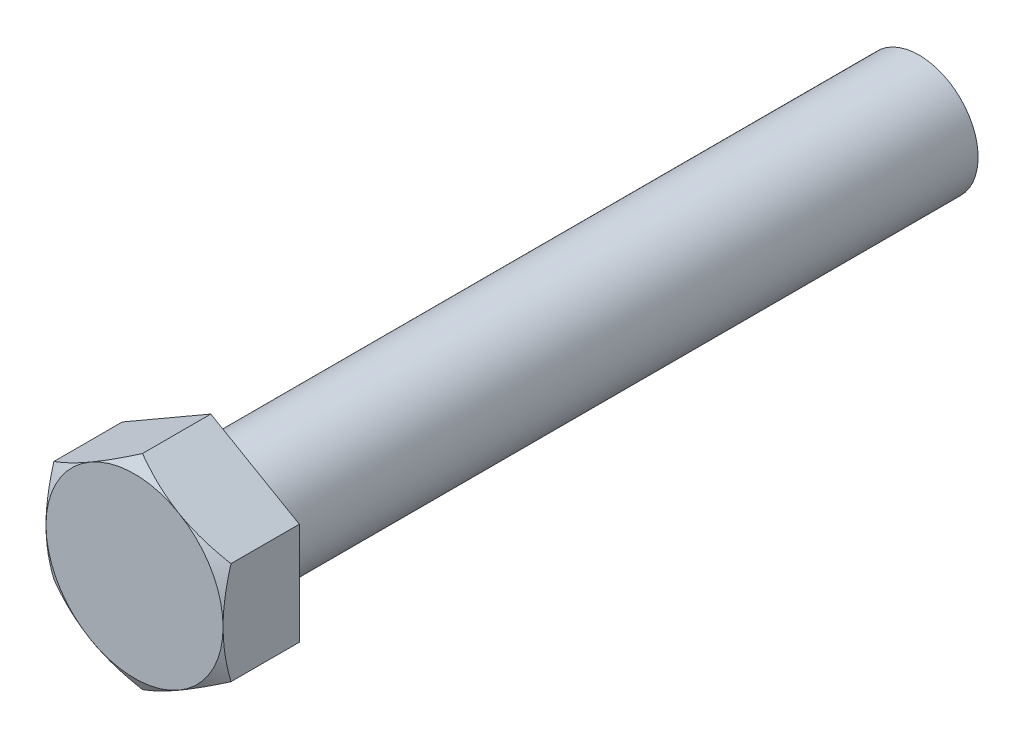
ISO-10303-21;
HEADER;
FILE_DESCRIPTION(('STEP AP214'),'2;1');
FILE_NAME('part.step','',(''),(''),'','','');
FILE_SCHEMA(('AUTOMOTIVE_DESIGN { 1 0 10303 214 1 1 1 1 }'));
ENDSEC;
DATA;
#1=APPLICATION_CONTEXT('core data for automotive mechanical design processes');
#2=APPLICATION_PROTOCOL_DEFINITION('international standard','automotive_design',2000,#1);
#3=PRODUCT_CONTEXT('',#1,'mechanical');
#4=PRODUCT('Part','Part','',(#3));
#5=PRODUCT_RELATED_PRODUCT_CATEGORY('part','',(#4));
#6=PRODUCT_DEFINITION_FORMATION('','',#4);
#7=PRODUCT_DEFINITION_CONTEXT('part definition',#1,'design');
#8=PRODUCT_DEFINITION('design','',#6,#7);
#9=PRODUCT_DEFINITION_SHAPE('','',#8);
#10=(LENGTH_UNIT() NAMED_UNIT(*) SI_UNIT(.MILLI.,.METRE.));
#11=(NAMED_UNIT(*) PLANE_ANGLE_UNIT() SI_UNIT($,.RADIAN.));
#12=(NAMED_UNIT(*) SI_UNIT($,.STERADIAN.) SOLID_ANGLE_UNIT());
#13=UNCERTAINTY_MEASURE_WITH_UNIT(LENGTH_MEASURE(1.E-05),#10,'distance_accuracy_value','');
#14=(GEOMETRIC_REPRESENTATION_CONTEXT(3) GLOBAL_UNCERTAINTY_ASSIGNED_CONTEXT((#13)) GLOBAL_UNIT_ASSIGNED_CONTEXT((#10,
#11,#12)) REPRESENTATION_CONTEXT('',''));
#15=CARTESIAN_POINT('',(0.,0.,0.));
#16=DIRECTION('',(0.,0.,1.));
#17=DIRECTION('',(1.,0.,0.));
#18=AXIS2_PLACEMENT_3D('',#15,#16,#17);
#19=CARTESIAN_POINT('',(0.,0.,76.2));
#20=DIRECTION('',(0.,0.,-1.));
#21=DIRECTION('',(-1.,0.,0.));
#22=AXIS2_PLACEMENT_3D('',#19,#20,#21);
#23=CYLINDRICAL_SURFACE('',#22,6.35);
#24=CARTESIAN_POINT('',(0.,0.,76.2));
#25=DIRECTION('',(0.,0.,1.));
#26=DIRECTION('',(1.,0.,0.));
#27=AXIS2_PLACEMENT_3D('',#24,#25,#26);
#28=CIRCLE('',#27,6.35);
#29=CARTESIAN_POINT('',(-6.35,0.,76.2));
#30=VERTEX_POINT('',#29);
#31=EDGE_CURVE('E199',#30,#30,#28,.T.);
#32=CARTESIAN_POINT('',(0.,0.,0.));
#33=DIRECTION('',(0.,0.,1.));
#34=DIRECTION('',(1.,0.,0.));
#35=AXIS2_PLACEMENT_3D('',#32,#33,#34);
#36=CIRCLE('',#35,6.35);
#37=CARTESIAN_POINT('',(-6.35,0.,0.));
#38=VERTEX_POINT('',#37);
#39=EDGE_CURVE('E197',#38,#38,#36,.T.);
#40=CARTESIAN_POINT('',(-6.35,0.,76.2));
#41=CARTESIAN_POINT('',(-6.35,0.,75.40625));
#42=CARTESIAN_POINT('',(-6.35,0.,74.6125));
#43=CARTESIAN_POINT('',(-6.35,0.,73.025));
#44=CARTESIAN_POINT('',(-6.35,0.,72.23125));
#45=CARTESIAN_POINT('',(-6.35,0.,70.64375));
#46=CARTESIAN_POINT('',(-6.35,0.,69.85));
#47=CARTESIAN_POINT('',(-6.35,0.,68.2625));
#48=CARTESIAN_POINT('',(-6.35,0.,67.46875));
#49=CARTESIAN_POINT('',(-6.35,0.,65.88125));
#50=CARTESIAN_POINT('',(-6.35,0.,65.0875));
#51=CARTESIAN_POINT('',(-6.35,0.,63.5));
#52=CARTESIAN_POINT('',(-6.35,0.,62.70625));
#53=CARTESIAN_POINT('',(-6.35,0.,61.11875));
#54=CARTESIAN_POINT('',(-6.35,0.,60.325));
#55=CARTESIAN_POINT('',(-6.35,0.,58.7375));
#56=CARTESIAN_POINT('',(-6.35,0.,57.94375));
#57=CARTESIAN_POINT('',(-6.35,0.,56.35625));
#58=CARTESIAN_POINT('',(-6.35,0.,55.5625));
#59=CARTESIAN_POINT('',(-6.35,0.,53.975));
#60=CARTESIAN_POINT('',(-6.35,0.,53.18125));
#61=CARTESIAN_POINT('',(-6.35,0.,51.59375));
#62=CARTESIAN_POINT('',(-6.35,0.,50.8));
#63=CARTESIAN_POINT('',(-6.35,0.,49.2125));
#64=CARTESIAN_POINT('',(-6.35,0.,48.41875));
#65=CARTESIAN_POINT('',(-6.35,0.,46.83125));
#66=CARTESIAN_POINT('',(-6.35,0.,46.0375));
#67=CARTESIAN_POINT('',(-6.35,0.,44.45));
#68=CARTESIAN_POINT('',(-6.35,0.,43.65625));
#69=CARTESIAN_POINT('',(-6.35,0.,42.06875));
#70=CARTESIAN_POINT('',(-6.35,0.,41.275));
#71=CARTESIAN_POINT('',(-6.35,0.,39.6875));
#72=CARTESIAN_POINT('',(-6.35,0.,38.89375));
#73=CARTESIAN_POINT('',(-6.35,0.,37.30625));
#74=CARTESIAN_POINT('',(-6.35,0.,36.5125));
#75=CARTESIAN_POINT('',(-6.35,0.,34.925));
#76=CARTESIAN_POINT('',(-6.35,0.,34.13125));
#77=CARTESIAN_POINT('',(-6.35,0.,32.54375));
#78=CARTESIAN_POINT('',(-6.35,0.,31.75));
#79=CARTESIAN_POINT('',(-6.35,0.,30.1625));
#80=CARTESIAN_POINT('',(-6.35,0.,29.36875));
#81=CARTESIAN_POINT('',(-6.35,0.,27.78125));
#82=CARTESIAN_POINT('',(-6.35,0.,26.9875));
#83=CARTESIAN_POINT('',(-6.35,0.,25.4));
#84=CARTESIAN_POINT('',(-6.35,0.,24.60625));
#85=CARTESIAN_POINT('',(-6.35,0.,23.01875));
#86=CARTESIAN_POINT('',(-6.35,0.,22.225));
#87=CARTESIAN_POINT('',(-6.35,0.,20.6375));
#88=CARTESIAN_POINT('',(-6.35,0.,19.84375));
#89=CARTESIAN_POINT('',(-6.35,0.,18.25625));
#90=CARTESIAN_POINT('',(-6.35,0.,17.4625));
#91=CARTESIAN_POINT('',(-6.35,0.,15.875));
#92=CARTESIAN_POINT('',(-6.35,0.,15.08125));
#93=CARTESIAN_POINT('',(-6.35,0.,13.49375));
#94=CARTESIAN_POINT('',(-6.35,0.,12.7));
#95=CARTESIAN_POINT('',(-6.35,0.,11.1125));
#96=CARTESIAN_POINT('',(-6.35,0.,10.31875));
#97=CARTESIAN_POINT('',(-6.35,0.,8.73125));
#98=CARTESIAN_POINT('',(-6.35,0.,7.93750000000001));
#99=CARTESIAN_POINT('',(-6.35,0.,6.35));
#100=CARTESIAN_POINT('',(-6.35,0.,5.55625));
#101=CARTESIAN_POINT('',(-6.35,0.,3.96875));
#102=CARTESIAN_POINT('',(-6.35,0.,3.175));
#103=CARTESIAN_POINT('',(-6.35,0.,1.5875));
#104=CARTESIAN_POINT('',(-6.35,0.,0.793750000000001));
#105=CARTESIAN_POINT('',(-6.35,0.,0.));
#106=B_SPLINE_CURVE_WITH_KNOTS('',3,(#40,#41,#42,#43,#44,#45,#46,#47,#48,#49,#50,#51,#52,#53,
#54,#55,#56,#57,#58,#59,#60,#61,#62,#63,#64,#65,#66,#67,#68,#69,#70,#71,#72,#73,#74,#75,#76,#77,
#78,#79,#80,#81,#82,#83,#84,#85,#86,#87,#88,#89,#90,#91,#92,#93,#94,#95,#96,#97,#98,#99,#100,
#101,#102,#103,#104,#105),.UNSPECIFIED.,.F.,.F.,(4,2,2,2,2,2,2,2,2,2,2,2,2,2,2,2,2,2,2,2,2,2,2,
2,2,2,2,2,2,2,2,2,4),(0.,2.38124999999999,4.76249999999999,7.14374999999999,9.52499999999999,
11.90625,14.2875,16.66875,19.05,21.43125,23.8125,26.19375,28.575,30.95625,33.3375,35.71875,38.1,
40.48125,42.8625,45.24375,47.625,50.00625,52.3875,54.76875,57.15,59.53125,61.9125,64.29375,
66.675,69.05625,71.4375,73.81875,76.2),.UNSPECIFIED.);
#107=EDGE_CURVE('BSEAM30',#30,#38,#106,.T.);
#108=ORIENTED_EDGE('',*,*,#31,.F.);
#109=ORIENTED_EDGE('',*,*,#39,.T.);
#110=ORIENTED_EDGE('',*,*,#107,.T.);
#111=ORIENTED_EDGE('',*,*,#107,.F.);
#112=EDGE_LOOP('',(#108,#110,#109,#111));
#113=FACE_BOUND('',#112,.T.);
#114=ADVANCED_FACE('F30',(#113),#23,.T.);
#115=CARTESIAN_POINT('',(0.,0.,0.));
#116=DIRECTION('',(0.,0.,1.));
#117=DIRECTION('',(1.,0.,0.));
#118=AXIS2_PLACEMENT_3D('',#115,#116,#117);
#119=PLANE('',#118);
#120=ORIENTED_EDGE('',*,*,#39,.F.);
#121=EDGE_LOOP('',(#120));
#122=FACE_BOUND('',#121,.T.);
#123=ADVANCED_FACE('F186',(#122),#119,.F.);
#124=CARTESIAN_POINT('',(-9.525,5.49926131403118,76.2));
#125=DIRECTION('',(0.,0.,1.));
#126=DIRECTION('',(1.,0.,0.));
#127=AXIS2_PLACEMENT_3D('',#124,#125,#126);
#128=PLANE('',#127);
#129=DIRECTION('',(-0.866025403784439,-0.5,0.));
#130=VECTOR('',#129,1.);
#131=CARTESIAN_POINT('',(0.,10.9985226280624,76.2));
#132=LINE('',#131,#130);
#133=CARTESIAN_POINT('',(0.,10.9985226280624,76.2));
#134=VERTEX_POINT('',#133);
#135=CARTESIAN_POINT('',(-9.525,5.49926131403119,76.2));
#136=VERTEX_POINT('',#135);
#137=EDGE_CURVE('E228',#134,#136,#132,.T.);
#138=ORIENTED_EDGE('',*,*,#137,.F.);
#139=DIRECTION('',(0.866025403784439,-0.5,0.));
#140=VECTOR('',#139,1.);
#141=CARTESIAN_POINT('',(0.,10.9985226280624,76.2));
#142=LINE('',#141,#140);
#143=CARTESIAN_POINT('',(9.525,5.49926131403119,76.2));
#144=VERTEX_POINT('',#143);
#145=EDGE_CURVE('E214',#134,#144,#142,.T.);
#146=ORIENTED_EDGE('',*,*,#145,.T.);
#147=DIRECTION('',(0.,-1.,0.));
#148=VECTOR('',#147,1.);
#149=CARTESIAN_POINT('',(9.525,5.49926131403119,76.2));
#150=LINE('',#149,#148);
#151=CARTESIAN_POINT('',(9.525,-5.49926131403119,76.2));
#152=VERTEX_POINT('',#151);
#153=EDGE_CURVE('E217',#144,#152,#150,.T.);
#154=ORIENTED_EDGE('',*,*,#153,.T.);
#155=DIRECTION('',(-0.866025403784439,-0.5,0.));
#156=VECTOR('',#155,1.);
#157=CARTESIAN_POINT('',(9.525,-5.49926131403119,76.2));
#158=LINE('',#157,#156);
#159=CARTESIAN_POINT('',(0.,-10.9985226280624,76.2));
#160=VERTEX_POINT('',#159);
#161=EDGE_CURVE('E220',#152,#160,#158,.T.);
#162=ORIENTED_EDGE('',*,*,#161,.T.);
#163=DIRECTION('',(0.866025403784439,-0.5,0.));
#164=VECTOR('',#163,1.);
#165=CARTESIAN_POINT('',(-9.525,-5.49926131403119,76.2));
#166=LINE('',#165,#164);
#167=CARTESIAN_POINT('',(-9.525,-5.49926131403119,76.2));
#168=VERTEX_POINT('',#167);
#169=EDGE_CURVE('E223',#168,#160,#166,.T.);
#170=ORIENTED_EDGE('',*,*,#169,.F.);
#171=DIRECTION('',(0.,-1.,0.));
#172=VECTOR('',#171,1.);
#173=CARTESIAN_POINT('',(-9.525,5.49926131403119,76.2));
#174=LINE('',#173,#172);
#175=EDGE_CURVE('E226',#136,#168,#174,.T.);
#176=ORIENTED_EDGE('',*,*,#175,.F.);
#177=EDGE_LOOP('',(#138,#146,#154,#162,#170,#176));
#178=FACE_BOUND('',#177,.T.);
#179=ORIENTED_EDGE('',*,*,#31,.T.);
#180=EDGE_LOOP('',(#179));
#181=FACE_BOUND('',#180,.T.);
#182=ADVANCED_FACE('F141',(#178,#181),#128,.F.);
#183=CARTESIAN_POINT('',(0.,10.9985226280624,84.4042));
#184=DIRECTION('',(0.5,-0.866025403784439,0.));
#185=DIRECTION('',(0.866025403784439,0.5,0.));
#186=AXIS2_PLACEMENT_3D('',#183,#184,#185);
#187=PLANE('',#186);
#188=CARTESIAN_POINT('',(0.000199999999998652,10.9986380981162,83.5533946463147));
#189=CARTESIAN_POINT('',(-0.209180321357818,10.8777523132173,83.6231767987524));
#190=CARTESIAN_POINT('',(-0.419341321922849,10.7564158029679,83.6897917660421));
#191=CARTESIAN_POINT('',(-0.841348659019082,10.5127697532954,83.81580853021));
#192=CARTESIAN_POINT('',(-1.05319552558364,10.3904599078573,83.8752079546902));
#193=CARTESIAN_POINT('',(-1.69214962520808,10.0215595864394,84.0414333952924));
#194=CARTESIAN_POINT('',(-2.12177921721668,9.77351282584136,84.1359816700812));
#195=CARTESIAN_POINT('',(-2.76470023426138,9.40232220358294,84.2468483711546));
#196=CARTESIAN_POINT('',(-2.97607088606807,9.28028730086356,84.278430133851));
#197=CARTESIAN_POINT('',(-3.39979082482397,9.03565248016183,84.3313907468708));
#198=CARTESIAN_POINT('',(-3.61214013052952,8.9130525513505,84.352769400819));
#199=CARTESIAN_POINT('',(-4.03719295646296,8.66764818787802,84.3847760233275));
#200=CARTESIAN_POINT('',(-4.24989575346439,8.54484417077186,84.3954167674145));
#201=CARTESIAN_POINT('',(-4.67549782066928,8.29912270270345,84.4057214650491));
#202=CARTESIAN_POINT('',(-4.88839708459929,8.17620525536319,84.4053857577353));
#203=CARTESIAN_POINT('',(-5.28641747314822,7.94640807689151,84.3945011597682));
#204=CARTESIAN_POINT('',(-5.4715666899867,7.83951212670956,84.3852800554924));
#205=CARTESIAN_POINT('',(-5.84143209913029,7.62597023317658,84.3587151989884));
#206=CARTESIAN_POINT('',(-6.02614825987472,7.5193243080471,84.3413708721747));
#207=CARTESIAN_POINT('',(-6.57958100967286,7.19979976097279,84.2775631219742));
#208=CARTESIAN_POINT('',(-6.94731798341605,6.98748672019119,84.2193328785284));
#209=CARTESIAN_POINT('',(-7.68669273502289,6.56060850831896,84.0737567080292));
#210=CARTESIAN_POINT('',(-8.05823615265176,6.34609781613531,83.9857937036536));
#211=CARTESIAN_POINT('',(-8.79578238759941,5.92027529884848,83.786154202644));
#212=CARTESIAN_POINT('',(-9.16179464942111,5.70895802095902,83.6745245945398));
#213=CARTESIAN_POINT('',(-9.5252,5.49914584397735,83.5533946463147));
#214=B_SPLINE_CURVE_WITH_KNOTS('',3,(#188,#189,#190,#191,#192,#193,#194,#195,#196,#197,#198,
#199,#200,#201,#202,#203,#204,#205,#206,#207,#208,#209,#210,#211,#212,#213),.UNSPECIFIED.,.F.,
.F.,(4,2,2,2,2,2,2,2,2,2,2,2,4),(0.,0.754861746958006,1.50997101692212,3.02340406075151,
3.76154608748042,4.49970232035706,5.23697928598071,5.97423347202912,6.61604550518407,
7.25790294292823,8.54252993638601,9.85564695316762,11.1661863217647),.UNSPECIFIED.);
#215=CARTESIAN_POINT('',(0.,10.9985226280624,83.5534613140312));
#216=VERTEX_POINT('',#215);
#217=CARTESIAN_POINT('',(-4.7625,8.24889197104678,84.4042));
#218=VERTEX_POINT('',#217);
#219=EDGE_CURVE('E108',#216,#218,#214,.T.);
#220=ORIENTED_EDGE('',*,*,#219,.F.);
#221=DIRECTION('',(0.,0.,-1.));
#222=VECTOR('',#221,1.);
#223=CARTESIAN_POINT('',(0.,10.9985226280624,84.4042));
#224=LINE('',#223,#222);
#225=EDGE_CURVE('E121',#216,#134,#224,.T.);
#226=ORIENTED_EDGE('',*,*,#225,.T.);
#227=ORIENTED_EDGE('',*,*,#137,.T.);
#228=DIRECTION('',(0.,0.,-1.));
#229=VECTOR('',#228,1.);
#230=CARTESIAN_POINT('',(-9.525,5.49926131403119,84.4042));
#231=LINE('',#230,#229);
#232=CARTESIAN_POINT('',(-9.525,5.49926131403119,83.5534613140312));
#233=VERTEX_POINT('',#232);
#234=EDGE_CURVE('E200',#233,#136,#231,.T.);
#235=ORIENTED_EDGE('',*,*,#234,.F.);
#236=EDGE_CURVE('E255',#218,#233,#214,.T.);
#237=ORIENTED_EDGE('',*,*,#236,.F.);
#238=EDGE_LOOP('',(#220,#226,#227,#235,#237));
#239=FACE_BOUND('',#238,.T.);
#240=ADVANCED_FACE('F181',(#239),#187,.F.);
#241=CARTESIAN_POINT('',(-9.525,5.49926131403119,84.4042));
#242=DIRECTION('',(1.,0.,0.));
#243=DIRECTION('',(0.,1.,0.));
#244=AXIS2_PLACEMENT_3D('',#241,#242,#243);
#245=PLANE('',#244);
#246=CARTESIAN_POINT('',(-9.52499999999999,-15.0406624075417,79.624888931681));
#247=CARTESIAN_POINT('',(-9.52499999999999,-14.8314695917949,79.726924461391));
#248=CARTESIAN_POINT('',(-9.52499999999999,-14.6220384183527,79.8284710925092));
#249=CARTESIAN_POINT('',(-9.52499999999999,-14.2026497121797,80.0304763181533));
#250=CARTESIAN_POINT('',(-9.52499999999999,-13.9926921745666,80.1309349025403));
#251=CARTESIAN_POINT('',(-9.52499999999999,-13.36190316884,80.4305380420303));
#252=CARTESIAN_POINT('',(-9.52499999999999,-12.940213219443,80.6278816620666));
#253=CARTESIAN_POINT('',(-9.52499999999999,-12.0919310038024,81.0176281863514));
#254=CARTESIAN_POINT('',(-9.52499999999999,-11.6653246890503,81.210000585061));
#255=CARTESIAN_POINT('',(-9.52499999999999,-10.8088119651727,81.5872256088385));
#256=CARTESIAN_POINT('',(-9.52499999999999,-10.3789057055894,81.772078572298));
#257=CARTESIAN_POINT('',(-9.52499999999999,-9.50033997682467,82.1384419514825));
#258=CARTESIAN_POINT('',(-9.52499999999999,-9.0515419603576,82.3196218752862));
#259=CARTESIAN_POINT('',(-9.52499999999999,-8.14879690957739,82.6689095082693));
#260=CARTESIAN_POINT('',(-9.525,-7.6948493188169,82.8370157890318));
#261=CARTESIAN_POINT('',(-9.525,-6.78184303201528,83.1559390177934));
#262=CARTESIAN_POINT('',(-9.525,-6.32279590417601,83.3067887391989));
#263=CARTESIAN_POINT('',(-9.525,-5.3981384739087,83.5865389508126));
#264=CARTESIAN_POINT('',(-9.525,-4.93253020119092,83.7154460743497));
#265=CARTESIAN_POINT('',(-9.525,-3.9969954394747,83.9446125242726));
#266=CARTESIAN_POINT('',(-9.52499999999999,-3.52710966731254,84.0450336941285));
#267=CARTESIAN_POINT('',(-9.525,-2.81779554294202,84.1700845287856));
#268=CARTESIAN_POINT('',(-9.525,-2.58059477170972,84.2075062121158));
#269=CARTESIAN_POINT('',(-9.525,-2.10492505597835,84.2730960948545));
#270=CARTESIAN_POINT('',(-9.525,-1.86645623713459,84.301265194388));
#271=CARTESIAN_POINT('',(-9.525,-1.39180240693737,84.3474207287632));
#272=CARTESIAN_POINT('',(-9.525,-1.15563040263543,84.3655403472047));
#273=CARTESIAN_POINT('',(-9.525,-0.682730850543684,84.3917658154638));
#274=CARTESIAN_POINT('',(-9.525,-0.446003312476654,84.3998718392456));
#275=CARTESIAN_POINT('',(-9.525,0.0275845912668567,84.4058754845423));
#276=CARTESIAN_POINT('',(-9.525,0.264444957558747,84.4037730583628));
#277=CARTESIAN_POINT('',(-9.525,0.737860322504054,84.389413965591));
#278=CARTESIAN_POINT('',(-9.525,0.974415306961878,84.3771568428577));
#279=CARTESIAN_POINT('',(-9.525,1.53488964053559,84.3363512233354));
#280=CARTESIAN_POINT('',(-9.525,1.85849825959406,84.3034324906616));
#281=CARTESIAN_POINT('',(-9.525,2.50347270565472,84.2203273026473));
#282=CARTESIAN_POINT('',(-9.525,2.82483825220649,84.1701387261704));
#283=CARTESIAN_POINT('',(-9.525,3.78510442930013,83.9963166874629));
#284=CARTESIAN_POINT('',(-9.525,4.41986459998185,83.8494526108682));
#285=CARTESIAN_POINT('',(-9.525,5.36956818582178,83.5927029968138));
#286=CARTESIAN_POINT('',(-9.525,5.68937698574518,83.4997612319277));
#287=CARTESIAN_POINT('',(-9.525,6.32589361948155,83.3037102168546));
#288=CARTESIAN_POINT('',(-9.525,6.64260142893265,83.2006008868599));
#289=CARTESIAN_POINT('',(-9.525,7.27300970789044,82.9859114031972));
#290=CARTESIAN_POINT('',(-9.525,7.58671097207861,82.8743335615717));
#291=CARTESIAN_POINT('',(-9.525,8.21147690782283,82.6440710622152));
#292=CARTESIAN_POINT('',(-9.525,8.52254164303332,82.525386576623));
#293=CARTESIAN_POINT('',(-9.525,9.36987521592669,82.1927669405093));
#294=CARTESIAN_POINT('',(-9.525,9.90380457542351,81.972877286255));
#295=CARTESIAN_POINT('',(-9.525,10.9660580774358,81.5199035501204));
#296=CARTESIAN_POINT('',(-9.525,11.4943815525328,81.2868179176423));
#297=CARTESIAN_POINT('',(-9.525,12.5467322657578,80.8106189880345));
#298=CARTESIAN_POINT('',(-9.525,13.0707576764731,80.5675016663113));
#299=CARTESIAN_POINT('',(-9.525,14.1151779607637,80.0736737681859));
#300=CARTESIAN_POINT('',(-9.525,14.6355729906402,79.8229635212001));
#301=CARTESIAN_POINT('',(-9.525,15.6743306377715,79.3152004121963));
#302=CARTESIAN_POINT('',(-9.525,16.1926884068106,79.0581376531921));
#303=CARTESIAN_POINT('',(-9.525,17.2270504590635,78.5393166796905));
#304=CARTESIAN_POINT('',(-9.525,17.7430547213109,78.2775584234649));
#305=CARTESIAN_POINT('',(-9.525,18.7730147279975,77.7503410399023));
#306=CARTESIAN_POINT('',(-9.525,19.2869709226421,77.4848827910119));
#307=CARTESIAN_POINT('',(-9.525,20.3132919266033,76.9509058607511));
#308=CARTESIAN_POINT('',(-9.525,20.8256567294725,76.6823871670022));
#309=CARTESIAN_POINT('',(-9.525,22.2501429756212,75.9314003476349));
#310=CARTESIAN_POINT('',(-9.525,23.1608246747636,75.4462018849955));
#311=CARTESIAN_POINT('',(-9.525,24.9791566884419,74.4700292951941));
#312=CARTESIAN_POINT('',(-9.52500000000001,25.8868068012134,73.9790547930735));
#313=CARTESIAN_POINT('',(-9.52500000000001,27.69662744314,72.9945162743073));
#314=CARTESIAN_POINT('',(-9.52500000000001,28.598806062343,72.5009671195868));
#315=CARTESIAN_POINT('',(-9.52500000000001,29.9506881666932,71.7582112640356));
#316=CARTESIAN_POINT('',(-9.52500000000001,30.4010662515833,71.5102307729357));
#317=CARTESIAN_POINT('',(-9.52500000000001,31.301421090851,71.013543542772));
#318=CARTESIAN_POINT('',(-9.52500000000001,31.7513978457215,70.7648368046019));
#319=CARTESIAN_POINT('',(-9.52500000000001,32.2011986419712,70.5158121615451));
#320=B_SPLINE_CURVE_WITH_KNOTS('',3,(#246,#247,#248,#249,#250,#251,#252,#253,#254,#255,#256,
#257,#258,#259,#260,#261,#262,#263,#264,#265,#266,#267,#268,#269,#270,#271,#272,#273,#274,#275,
#276,#277,#278,#279,#280,#281,#282,#283,#284,#285,#286,#287,#288,#289,#290,#291,#292,#293,#294,
#295,#296,#297,#298,#299,#300,#301,#302,#303,#304,#305,#306,#307,#308,#309,#310,#311,#312,#313,
#314,#315,#316,#317,#318,#319),.UNSPECIFIED.,.F.,.F.,(4,2,2,2,2,2,2,2,2,2,2,2,2,2,2,2,2,2,2,2,2,
2,2,2,2,2,2,2,2,2,2,2,2,2,2,2,4),(0.,0.698250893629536,1.39650828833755,2.79321646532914,
4.19708297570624,5.60088623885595,7.05269653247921,8.50466522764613,9.95382890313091,
11.4025537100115,12.8428747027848,13.5631263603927,14.2833079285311,14.9937019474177,
15.7040836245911,16.414468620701,17.1248855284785,18.1001761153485,19.075586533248,
21.0273363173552,22.0263661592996,23.0254038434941,24.0241697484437,25.0229114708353,
26.7549509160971,28.4871943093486,30.2201395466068,31.953009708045,33.6887750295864,
35.4245557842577,37.1599312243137,38.895313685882,41.9908956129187,45.0866796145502,
48.1717395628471,49.7141439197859,51.2565463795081),.UNSPECIFIED.);
#321=CARTESIAN_POINT('',(-9.525,0.,84.4042));
#322=VERTEX_POINT('',#321);
#323=EDGE_CURVE('E230',#233,#322,#320,.F.);
#324=ORIENTED_EDGE('',*,*,#323,.F.);
#325=ORIENTED_EDGE('',*,*,#234,.T.);
#326=ORIENTED_EDGE('',*,*,#175,.T.);
#327=DIRECTION('',(0.,0.,-1.));
#328=VECTOR('',#327,1.);
#329=CARTESIAN_POINT('',(-9.525,-5.49926131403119,84.4042));
#330=LINE('',#329,#328);
#331=CARTESIAN_POINT('',(-9.525,-5.49926131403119,83.5534613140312));
#332=VERTEX_POINT('',#331);
#333=EDGE_CURVE('E203',#332,#168,#330,.T.);
#334=ORIENTED_EDGE('',*,*,#333,.F.);
#335=EDGE_CURVE('E166',#322,#332,#320,.F.);
#336=ORIENTED_EDGE('',*,*,#335,.F.);
#337=EDGE_LOOP('',(#324,#325,#326,#334,#336));
#338=FACE_BOUND('',#337,.T.);
#339=ADVANCED_FACE('F176',(#338),#245,.F.);
#340=CARTESIAN_POINT('',(-9.525,-5.49926131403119,84.4042));
#341=DIRECTION('',(0.5,0.866025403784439,0.));
#342=DIRECTION('',(-0.866025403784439,0.5,0.));
#343=AXIS2_PLACEMENT_3D('',#340,#341,#342);
#344=PLANE('',#343);
#345=CARTESIAN_POINT('',(-9.5252,-5.49914584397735,83.5533946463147));
#346=CARTESIAN_POINT('',(-9.31581967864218,-5.6200316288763,83.6231767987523));
#347=CARTESIAN_POINT('',(-9.10565867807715,-5.74136813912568,83.6897917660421));
#348=CARTESIAN_POINT('',(-8.68365134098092,-5.98501418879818,83.81580853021));
#349=CARTESIAN_POINT('',(-8.47180447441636,-6.10732403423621,83.8752079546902));
#350=CARTESIAN_POINT('',(-7.83285037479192,-6.4762243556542,84.0414333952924));
#351=CARTESIAN_POINT('',(-7.40322078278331,-6.72427111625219,84.1359816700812));
#352=CARTESIAN_POINT('',(-6.76029976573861,-7.09546173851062,84.2468483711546));
#353=CARTESIAN_POINT('',(-6.54892911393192,-7.21749664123,84.278430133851));
#354=CARTESIAN_POINT('',(-6.12520917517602,-7.46213146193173,84.3313907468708));
#355=CARTESIAN_POINT('',(-5.91285986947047,-7.58473139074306,84.352769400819));
#356=CARTESIAN_POINT('',(-5.48780704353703,-7.83013575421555,84.3847760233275));
#357=CARTESIAN_POINT('',(-5.2751042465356,-7.9529397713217,84.3954167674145));
#358=CARTESIAN_POINT('',(-4.84950217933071,-8.19866123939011,84.4057214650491));
#359=CARTESIAN_POINT('',(-4.6366029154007,-8.32157868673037,84.4053857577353));
#360=CARTESIAN_POINT('',(-4.23858252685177,-8.55137586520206,84.3945011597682));
#361=CARTESIAN_POINT('',(-4.05343331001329,-8.658271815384,84.3852800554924));
#362=CARTESIAN_POINT('',(-3.6835679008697,-8.87181370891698,84.3587151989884));
#363=CARTESIAN_POINT('',(-3.49885174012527,-8.97845963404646,84.3413708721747));
#364=CARTESIAN_POINT('',(-2.94541899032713,-9.29798418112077,84.2775631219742));
#365=CARTESIAN_POINT('',(-2.57768201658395,-9.51029722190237,84.2193328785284));
#366=CARTESIAN_POINT('',(-1.83830726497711,-9.93717543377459,84.0737567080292));
#367=CARTESIAN_POINT('',(-1.46676384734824,-10.1516861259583,83.9857937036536));
#368=CARTESIAN_POINT('',(-0.729217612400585,-10.5775086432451,83.786154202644));
#369=CARTESIAN_POINT('',(-0.363205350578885,-10.7888259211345,83.6745245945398));
#370=CARTESIAN_POINT('',(0.000199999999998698,-10.9986380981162,83.5533946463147));
#371=B_SPLINE_CURVE_WITH_KNOTS('',3,(#345,#346,#347,#348,#349,#350,#351,#352,#353,#354,#355,
#356,#357,#358,#359,#360,#361,#362,#363,#364,#365,#366,#367,#368,#369,#370),.UNSPECIFIED.,.F.,
.F.,(4,2,2,2,2,2,2,2,2,2,2,2,4),(0.,0.754861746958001,1.50997101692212,3.02340406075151,
3.76154608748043,4.49970232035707,5.23697928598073,5.97423347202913,6.61604550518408,
7.25790294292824,8.54252993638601,9.85564695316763,11.1661863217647),.UNSPECIFIED.);
#372=CARTESIAN_POINT('',(-4.7625,-8.24889197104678,84.4042));
#373=VERTEX_POINT('',#372);
#374=EDGE_CURVE('E164',#332,#373,#371,.T.);
#375=ORIENTED_EDGE('',*,*,#374,.F.);
#376=ORIENTED_EDGE('',*,*,#333,.T.);
#377=ORIENTED_EDGE('',*,*,#169,.T.);
#378=DIRECTION('',(0.,0.,-1.));
#379=VECTOR('',#378,1.);
#380=CARTESIAN_POINT('',(0.,-10.9985226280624,84.4042));
#381=LINE('',#380,#379);
#382=CARTESIAN_POINT('',(0.,-10.9985226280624,83.5534613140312));
#383=VERTEX_POINT('',#382);
#384=EDGE_CURVE('E207',#383,#160,#381,.T.);
#385=ORIENTED_EDGE('',*,*,#384,.F.);
#386=EDGE_CURVE('E159',#373,#383,#371,.T.);
#387=ORIENTED_EDGE('',*,*,#386,.F.);
#388=EDGE_LOOP('',(#375,#376,#377,#385,#387));
#389=FACE_BOUND('',#388,.T.);
#390=ADVANCED_FACE('F172',(#389),#344,.F.);
#391=CARTESIAN_POINT('',(9.525,-5.49926131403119,84.4042));
#392=DIRECTION('',(0.5,-0.866025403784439,0.));
#393=DIRECTION('',(0.866025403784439,0.5,0.));
#394=AXIS2_PLACEMENT_3D('',#391,#392,#393);
#395=PLANE('',#394);
#396=DIRECTION('',(0.,0.,-1.));
#397=VECTOR('',#396,1.);
#398=CARTESIAN_POINT('',(9.525,-5.49926131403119,84.4042));
#399=LINE('',#398,#397);
#400=CARTESIAN_POINT('',(9.525,-5.49926131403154,83.5534613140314));
#401=VERTEX_POINT('',#400);
#402=EDGE_CURVE('E209',#401,#152,#399,.T.);
#403=ORIENTED_EDGE('',*,*,#402,.F.);
#404=CARTESIAN_POINT('',(9.5252,-5.49914584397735,83.5533946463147));
#405=CARTESIAN_POINT('',(9.31581967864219,-5.62003162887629,83.6231767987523));
#406=CARTESIAN_POINT('',(9.10565867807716,-5.74136813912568,83.6897917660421));
#407=CARTESIAN_POINT('',(8.68365134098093,-5.98501418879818,83.81580853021));
#408=CARTESIAN_POINT('',(8.47180447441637,-6.10732403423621,83.8752079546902));
#409=CARTESIAN_POINT('',(7.83285037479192,-6.47622435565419,84.0414333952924));
#410=CARTESIAN_POINT('',(7.40322078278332,-6.72427111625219,84.1359816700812));
#411=CARTESIAN_POINT('',(6.76029976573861,-7.09546173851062,84.2468483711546));
#412=CARTESIAN_POINT('',(6.54892911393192,-7.21749664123,84.278430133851));
#413=CARTESIAN_POINT('',(6.12520917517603,-7.46213146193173,84.3313907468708));
#414=CARTESIAN_POINT('',(5.91285986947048,-7.58473139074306,84.352769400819));
#415=CARTESIAN_POINT('',(5.48780704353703,-7.83013575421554,84.3847760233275));
#416=CARTESIAN_POINT('',(5.27510424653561,-7.9529397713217,84.3954167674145));
#417=CARTESIAN_POINT('',(4.84950217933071,-8.19866123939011,84.4057214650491));
#418=CARTESIAN_POINT('',(4.6366029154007,-8.32157868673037,84.4053857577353));
#419=CARTESIAN_POINT('',(4.23858252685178,-8.55137586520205,84.3945011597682));
#420=CARTESIAN_POINT('',(4.0534333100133,-8.658271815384,84.3852800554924));
#421=CARTESIAN_POINT('',(3.68356790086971,-8.87181370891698,84.3587151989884));
#422=CARTESIAN_POINT('',(3.49885174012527,-8.97845963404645,84.3413708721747));
#423=CARTESIAN_POINT('',(2.94541899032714,-9.29798418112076,84.2775631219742));
#424=CARTESIAN_POINT('',(2.57768201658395,-9.51029722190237,84.2193328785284));
#425=CARTESIAN_POINT('',(1.83830726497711,-9.93717543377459,84.0737567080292));
#426=CARTESIAN_POINT('',(1.46676384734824,-10.1516861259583,83.9857937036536));
#427=CARTESIAN_POINT('',(0.729217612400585,-10.5775086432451,83.786154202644));
#428=CARTESIAN_POINT('',(0.363205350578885,-10.7888259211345,83.6745245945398));
#429=CARTESIAN_POINT('',(-0.000200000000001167,-10.9986380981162,83.5533946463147));
#430=B_SPLINE_CURVE_WITH_KNOTS('',3,(#404,#405,#406,#407,#408,#409,#410,#411,#412,#413,#414,
#415,#416,#417,#418,#419,#420,#421,#422,#423,#424,#425,#426,#427,#428,#429),.UNSPECIFIED.,.F.,
.F.,(4,2,2,2,2,2,2,2,2,2,2,2,4),(0.,0.754861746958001,1.50997101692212,3.02340406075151,
3.76154608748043,4.49970232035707,5.23697928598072,5.97423347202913,6.61604550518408,
7.25790294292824,8.54252993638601,9.85564695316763,11.1661863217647),.UNSPECIFIED.);
#431=CARTESIAN_POINT('',(4.7625,-8.24889197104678,84.4042));
#432=VERTEX_POINT('',#431);
#433=EDGE_CURVE('E153',#401,#432,#430,.T.);
#434=ORIENTED_EDGE('',*,*,#433,.T.);
#435=EDGE_CURVE('E165',#432,#383,#430,.T.);
#436=ORIENTED_EDGE('',*,*,#435,.T.);
#437=ORIENTED_EDGE('',*,*,#384,.T.);
#438=ORIENTED_EDGE('',*,*,#161,.F.);
#439=EDGE_LOOP('',(#403,#434,#436,#437,#438));
#440=FACE_BOUND('',#439,.T.);
#441=ADVANCED_FACE('F175',(#440),#395,.T.);
#442=CARTESIAN_POINT('',(9.525,5.49926131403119,84.4042));
#443=DIRECTION('',(1.,0.,0.));
#444=DIRECTION('',(0.,0.,-1.));
#445=AXIS2_PLACEMENT_3D('',#442,#443,#444);
#446=PLANE('',#445);
#447=DIRECTION('',(0.,0.,-1.));
#448=VECTOR('',#447,1.);
#449=CARTESIAN_POINT('',(9.525,5.49926131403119,84.4042));
#450=LINE('',#449,#448);
#451=CARTESIAN_POINT('',(9.525,5.49926131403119,83.5534613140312));
#452=VERTEX_POINT('',#451);
#453=EDGE_CURVE('E211',#452,#144,#450,.T.);
#454=ORIENTED_EDGE('',*,*,#453,.F.);
#455=CARTESIAN_POINT('',(9.525,-15.0406624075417,79.624888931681));
#456=CARTESIAN_POINT('',(9.525,-14.8314695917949,79.726924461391));
#457=CARTESIAN_POINT('',(9.525,-14.6220384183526,79.8284710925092));
#458=CARTESIAN_POINT('',(9.525,-14.2026497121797,80.0304763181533));
#459=CARTESIAN_POINT('',(9.525,-13.9926921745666,80.1309349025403));
#460=CARTESIAN_POINT('',(9.525,-13.36190316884,80.4305380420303));
#461=CARTESIAN_POINT('',(9.525,-12.940213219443,80.6278816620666));
#462=CARTESIAN_POINT('',(9.525,-12.0919310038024,81.0176281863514));
#463=CARTESIAN_POINT('',(9.525,-11.6653246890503,81.210000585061));
#464=CARTESIAN_POINT('',(9.525,-10.8088119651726,81.5872256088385));
#465=CARTESIAN_POINT('',(9.525,-10.3789057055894,81.772078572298));
#466=CARTESIAN_POINT('',(9.525,-9.50033997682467,82.1384419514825));
#467=CARTESIAN_POINT('',(9.525,-9.05154196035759,82.3196218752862));
#468=CARTESIAN_POINT('',(9.525,-8.14879690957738,82.6689095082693));
#469=CARTESIAN_POINT('',(9.525,-7.6948493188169,82.8370157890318));
#470=CARTESIAN_POINT('',(9.525,-6.78184303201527,83.1559390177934));
#471=CARTESIAN_POINT('',(9.525,-6.322795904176,83.3067887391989));
#472=CARTESIAN_POINT('',(9.525,-5.3981384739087,83.5865389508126));
#473=CARTESIAN_POINT('',(9.525,-4.93253020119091,83.7154460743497));
#474=CARTESIAN_POINT('',(9.525,-3.9969954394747,83.9446125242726));
#475=CARTESIAN_POINT('',(9.525,-3.52710966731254,84.0450336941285));
#476=CARTESIAN_POINT('',(9.525,-2.81779554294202,84.1700845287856));
#477=CARTESIAN_POINT('',(9.525,-2.58059477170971,84.2075062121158));
#478=CARTESIAN_POINT('',(9.525,-2.10492505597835,84.2730960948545));
#479=CARTESIAN_POINT('',(9.525,-1.86645623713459,84.301265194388));
#480=CARTESIAN_POINT('',(9.525,-1.39180240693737,84.3474207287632));
#481=CARTESIAN_POINT('',(9.525,-1.15563040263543,84.3655403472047));
#482=CARTESIAN_POINT('',(9.525,-0.682730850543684,84.3917658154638));
#483=CARTESIAN_POINT('',(9.525,-0.446003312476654,84.3998718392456));
#484=CARTESIAN_POINT('',(9.525,0.0275845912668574,84.4058754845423));
#485=CARTESIAN_POINT('',(9.525,0.264444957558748,84.4037730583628));
#486=CARTESIAN_POINT('',(9.525,0.737860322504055,84.389413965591));
#487=CARTESIAN_POINT('',(9.525,0.974415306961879,84.3771568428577));
#488=CARTESIAN_POINT('',(9.525,1.53488964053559,84.3363512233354));
#489=CARTESIAN_POINT('',(9.525,1.85849825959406,84.3034324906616));
#490=CARTESIAN_POINT('',(9.525,2.50347270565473,84.2203273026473));
#491=CARTESIAN_POINT('',(9.525,2.8248382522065,84.1701387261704));
#492=CARTESIAN_POINT('',(9.525,3.78510442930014,83.9963166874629));
#493=CARTESIAN_POINT('',(9.525,4.41986459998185,83.8494526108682));
#494=CARTESIAN_POINT('',(9.525,5.36956818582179,83.5927029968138));
#495=CARTESIAN_POINT('',(9.525,5.68937698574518,83.4997612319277));
#496=CARTESIAN_POINT('',(9.525,6.32589361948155,83.3037102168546));
#497=CARTESIAN_POINT('',(9.525,6.64260142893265,83.2006008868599));
#498=CARTESIAN_POINT('',(9.525,7.27300970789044,82.9859114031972));
#499=CARTESIAN_POINT('',(9.525,7.58671097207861,82.8743335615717));
#500=CARTESIAN_POINT('',(9.525,8.21147690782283,82.6440710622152));
#501=CARTESIAN_POINT('',(9.525,8.52254164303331,82.525386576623));
#502=CARTESIAN_POINT('',(9.525,9.36987521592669,82.1927669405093));
#503=CARTESIAN_POINT('',(9.525,9.90380457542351,81.972877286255));
#504=CARTESIAN_POINT('',(9.525,10.9660580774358,81.5199035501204));
#505=CARTESIAN_POINT('',(9.525,11.4943815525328,81.2868179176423));
#506=CARTESIAN_POINT('',(9.525,12.5467322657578,80.8106189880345));
#507=CARTESIAN_POINT('',(9.525,13.0707576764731,80.5675016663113));
#508=CARTESIAN_POINT('',(9.525,14.1151779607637,80.0736737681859));
#509=CARTESIAN_POINT('',(9.525,14.6355729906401,79.8229635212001));
#510=CARTESIAN_POINT('',(9.525,15.6743306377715,79.3152004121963));
#511=CARTESIAN_POINT('',(9.525,16.1926884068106,79.0581376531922));
#512=CARTESIAN_POINT('',(9.525,17.2270504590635,78.5393166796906));
#513=CARTESIAN_POINT('',(9.525,17.7430547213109,78.277558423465));
#514=CARTESIAN_POINT('',(9.525,18.7730147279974,77.7503410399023));
#515=CARTESIAN_POINT('',(9.525,19.2869709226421,77.4848827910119));
#516=CARTESIAN_POINT('',(9.525,20.3132919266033,76.9509058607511));
#517=CARTESIAN_POINT('',(9.525,20.8256567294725,76.6823871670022));
#518=CARTESIAN_POINT('',(9.525,22.2501429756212,75.9314003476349));
#519=CARTESIAN_POINT('',(9.525,23.1608246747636,75.4462018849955));
#520=CARTESIAN_POINT('',(9.525,24.9791566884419,74.4700292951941));
#521=CARTESIAN_POINT('',(9.525,25.8868068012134,73.9790547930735));
#522=CARTESIAN_POINT('',(9.525,27.69662744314,72.9945162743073));
#523=CARTESIAN_POINT('',(9.525,28.598806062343,72.5009671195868));
#524=CARTESIAN_POINT('',(9.525,29.9506881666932,71.7582112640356));
#525=CARTESIAN_POINT('',(9.525,30.4010662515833,71.5102307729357));
#526=CARTESIAN_POINT('',(9.525,31.301421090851,71.013543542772));
#527=CARTESIAN_POINT('',(9.525,31.7513978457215,70.7648368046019));
#528=CARTESIAN_POINT('',(9.525,32.2011986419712,70.5158121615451));
#529=B_SPLINE_CURVE_WITH_KNOTS('',3,(#455,#456,#457,#458,#459,#460,#461,#462,#463,#464,#465,
#466,#467,#468,#469,#470,#471,#472,#473,#474,#475,#476,#477,#478,#479,#480,#481,#482,#483,#484,
#485,#486,#487,#488,#489,#490,#491,#492,#493,#494,#495,#496,#497,#498,#499,#500,#501,#502,#503,
#504,#505,#506,#507,#508,#509,#510,#511,#512,#513,#514,#515,#516,#517,#518,#519,#520,#521,#522,
#523,#524,#525,#526,#527,#528),.UNSPECIFIED.,.F.,.F.,(4,2,2,2,2,2,2,2,2,2,2,2,2,2,2,2,2,2,2,2,2,
2,2,2,2,2,2,2,2,2,2,2,2,2,2,2,4),(0.,0.698250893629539,1.39650828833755,2.79321646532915,
4.19708297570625,5.60088623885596,7.05269653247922,8.50466522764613,9.95382890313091,
11.4025537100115,12.8428747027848,13.5631263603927,14.2833079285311,14.9937019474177,
15.7040836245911,16.414468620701,17.1248855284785,18.1001761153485,19.075586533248,
21.0273363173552,22.0263661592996,23.0254038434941,24.0241697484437,25.0229114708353,
26.7549509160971,28.4871943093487,30.2201395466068,31.953009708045,33.6887750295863,
35.4245557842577,37.1599312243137,38.8953136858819,41.9908956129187,45.0866796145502,
48.1717395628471,49.7141439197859,51.2565463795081),.UNSPECIFIED.);
#530=CARTESIAN_POINT('',(9.525,0.,84.4042));
#531=VERTEX_POINT('',#530);
#532=EDGE_CURVE('E49',#452,#531,#529,.F.);
#533=ORIENTED_EDGE('',*,*,#532,.T.);
#534=EDGE_CURVE('E123',#531,#401,#529,.F.);
#535=ORIENTED_EDGE('',*,*,#534,.T.);
#536=ORIENTED_EDGE('',*,*,#402,.T.);
#537=ORIENTED_EDGE('',*,*,#153,.F.);
#538=EDGE_LOOP('',(#454,#533,#535,#536,#537));
#539=FACE_BOUND('',#538,.T.);
#540=ADVANCED_FACE('F258',(#539),#446,.T.);
#541=CARTESIAN_POINT('',(0.,10.9985226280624,84.4042));
#542=DIRECTION('',(0.5,0.866025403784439,0.));
#543=DIRECTION('',(-0.866025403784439,0.5,0.));
#544=AXIS2_PLACEMENT_3D('',#541,#542,#543);
#545=PLANE('',#544);
#546=ORIENTED_EDGE('',*,*,#225,.F.);
#547=CARTESIAN_POINT('',(-0.000199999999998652,10.9986380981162,83.5533946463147));
#548=CARTESIAN_POINT('',(0.209180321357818,10.8777523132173,83.6231767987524));
#549=CARTESIAN_POINT('',(0.41934132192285,10.7564158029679,83.6897917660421));
#550=CARTESIAN_POINT('',(0.841348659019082,10.5127697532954,83.81580853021));
#551=CARTESIAN_POINT('',(1.05319552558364,10.3904599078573,83.8752079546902));
#552=CARTESIAN_POINT('',(1.69214962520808,10.0215595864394,84.0414333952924));
#553=CARTESIAN_POINT('',(2.12177921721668,9.77351282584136,84.1359816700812));
#554=CARTESIAN_POINT('',(2.76470023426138,9.40232220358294,84.2468483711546));
#555=CARTESIAN_POINT('',(2.97607088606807,9.28028730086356,84.278430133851));
#556=CARTESIAN_POINT('',(3.39979082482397,9.03565248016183,84.3313907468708));
#557=CARTESIAN_POINT('',(3.61214013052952,8.9130525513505,84.352769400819));
#558=CARTESIAN_POINT('',(4.03719295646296,8.66764818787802,84.3847760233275));
#559=CARTESIAN_POINT('',(4.24989575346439,8.54484417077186,84.3954167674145));
#560=CARTESIAN_POINT('',(4.67549782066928,8.29912270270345,84.4057214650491));
#561=CARTESIAN_POINT('',(4.88839708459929,8.17620525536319,84.4053857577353));
#562=CARTESIAN_POINT('',(5.28641747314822,7.94640807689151,84.3945011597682));
#563=CARTESIAN_POINT('',(5.4715666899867,7.83951212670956,84.3852800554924));
#564=CARTESIAN_POINT('',(5.84143209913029,7.62597023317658,84.3587151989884));
#565=CARTESIAN_POINT('',(6.02614825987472,7.51932430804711,84.3413708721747));
#566=CARTESIAN_POINT('',(6.57958100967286,7.19979976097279,84.2775631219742));
#567=CARTESIAN_POINT('',(6.94731798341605,6.98748672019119,84.2193328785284));
#568=CARTESIAN_POINT('',(7.68669273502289,6.56060850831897,84.0737567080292));
#569=CARTESIAN_POINT('',(8.05823615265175,6.34609781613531,83.9857937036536));
#570=CARTESIAN_POINT('',(8.79578238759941,5.92027529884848,83.786154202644));
#571=CARTESIAN_POINT('',(9.16179464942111,5.70895802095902,83.6745245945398));
#572=CARTESIAN_POINT('',(9.5252,5.49914584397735,83.5533946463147));
#573=B_SPLINE_CURVE_WITH_KNOTS('',3,(#547,#548,#549,#550,#551,#552,#553,#554,#555,#556,#557,
#558,#559,#560,#561,#562,#563,#564,#565,#566,#567,#568,#569,#570,#571,#572),.UNSPECIFIED.,.F.,
.F.,(4,2,2,2,2,2,2,2,2,2,2,2,4),(0.,0.754861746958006,1.50997101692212,3.02340406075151,
3.76154608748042,4.49970232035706,5.23697928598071,5.97423347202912,6.61604550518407,
7.25790294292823,8.54252993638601,9.85564695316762,11.1661863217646),.UNSPECIFIED.);
#574=CARTESIAN_POINT('',(4.7625,8.24889197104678,84.4042));
#575=VERTEX_POINT('',#574);
#576=EDGE_CURVE('E103',#216,#575,#573,.T.);
#577=ORIENTED_EDGE('',*,*,#576,.T.);
#578=EDGE_CURVE('E97',#575,#452,#573,.T.);
#579=ORIENTED_EDGE('',*,*,#578,.T.);
#580=ORIENTED_EDGE('',*,*,#453,.T.);
#581=ORIENTED_EDGE('',*,*,#145,.F.);
#582=EDGE_LOOP('',(#546,#577,#579,#580,#581));
#583=FACE_BOUND('',#582,.T.);
#584=ADVANCED_FACE('F119',(#583),#545,.T.);
#585=CARTESIAN_POINT('',(0.,0.,84.4042));
#586=DIRECTION('',(0.,0.,-1.));
#587=DIRECTION('',(1.,0.,0.));
#588=AXIS2_PLACEMENT_3D('',#585,#586,#587);
#589=CONICAL_SURFACE('',#588,9.525,1.0471975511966);
#590=ORIENTED_EDGE('',*,*,#433,.F.);
#591=ORIENTED_EDGE('',*,*,#534,.F.);
#592=CARTESIAN_POINT('',(0.,0.,84.4042));
#593=DIRECTION('',(0.,0.,1.));
#594=DIRECTION('',(1.,0.,0.));
#595=AXIS2_PLACEMENT_3D('',#592,#593,#594);
#596=CIRCLE('',#595,9.525);
#597=EDGE_CURVE('E33',#432,#531,#596,.T.);
#598=ORIENTED_EDGE('',*,*,#597,.F.);
#599=EDGE_LOOP('',(#590,#591,#598));
#600=FACE_BOUND('',#599,.T.);
#601=ADVANCED_FACE('F140',(#600),#589,.T.);
#602=EDGE_CURVE('E246',#373,#432,#596,.T.);
#603=ORIENTED_EDGE('',*,*,#602,.F.);
#604=ORIENTED_EDGE('',*,*,#386,.T.);
#605=ORIENTED_EDGE('',*,*,#435,.F.);
#606=EDGE_LOOP('',(#603,#604,#605));
#607=FACE_BOUND('',#606,.T.);
#608=ADVANCED_FACE('F247',(#607),#589,.T.);
#609=EDGE_CURVE('E242',#322,#373,#596,.T.);
#610=ORIENTED_EDGE('',*,*,#609,.F.);
#611=ORIENTED_EDGE('',*,*,#335,.T.);
#612=ORIENTED_EDGE('',*,*,#374,.T.);
#613=EDGE_LOOP('',(#610,#611,#612));
#614=FACE_BOUND('',#613,.T.);
#615=ADVANCED_FACE('F240',(#614),#589,.T.);
#616=ORIENTED_EDGE('',*,*,#236,.T.);
#617=ORIENTED_EDGE('',*,*,#323,.T.);
#618=EDGE_CURVE('E38',#218,#322,#596,.T.);
#619=ORIENTED_EDGE('',*,*,#618,.F.);
#620=EDGE_LOOP('',(#616,#617,#619));
#621=FACE_BOUND('',#620,.T.);
#622=ADVANCED_FACE('F139',(#621),#589,.T.);
#623=ORIENTED_EDGE('',*,*,#576,.F.);
#624=ORIENTED_EDGE('',*,*,#219,.T.);
#625=EDGE_CURVE('E11',#575,#218,#596,.T.);
#626=ORIENTED_EDGE('',*,*,#625,.F.);
#627=EDGE_LOOP('',(#623,#624,#626));
#628=FACE_BOUND('',#627,.T.);
#629=ADVANCED_FACE('F106',(#628),#589,.T.);
#630=ORIENTED_EDGE('',*,*,#532,.F.);
#631=ORIENTED_EDGE('',*,*,#578,.F.);
#632=CARTESIAN_POINT('',(0.,0.,84.4042));
#633=DIRECTION('',(0.,0.,1.));
#634=DIRECTION('',(1.,0.,0.));
#635=AXIS2_PLACEMENT_3D('',#632,#633,#634);
#636=CIRCLE('',#635,9.525);
#637=EDGE_CURVE('E45',#531,#575,#636,.T.);
#638=ORIENTED_EDGE('',*,*,#637,.F.);
#639=EDGE_LOOP('',(#630,#631,#638));
#640=FACE_BOUND('',#639,.T.);
#641=ADVANCED_FACE('F99',(#640),#589,.T.);
#642=CARTESIAN_POINT('',(-9.525,5.49926131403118,84.4042));
#643=DIRECTION('',(0.,0.,1.));
#644=DIRECTION('',(1.,0.,0.));
#645=AXIS2_PLACEMENT_3D('',#642,#643,#644);
#646=PLANE('',#645);
#647=ORIENTED_EDGE('',*,*,#597,.T.);
#648=ORIENTED_EDGE('',*,*,#637,.T.);
#649=ORIENTED_EDGE('',*,*,#625,.T.);
#650=ORIENTED_EDGE('',*,*,#618,.T.);
#651=ORIENTED_EDGE('',*,*,#609,.T.);
#652=ORIENTED_EDGE('',*,*,#602,.T.);
#653=EDGE_LOOP('',(#647,#648,#649,#650,#651,#652));
#654=FACE_BOUND('',#653,.T.);
#655=ADVANCED_FACE('F114',(#654),#646,.T.);
#656=CLOSED_SHELL('',(#114,#123,#182,#240,#339,#390,#441,#540,#584,#601,#608,#615,#622,#629,
#641,#655));
#657=MANIFOLD_SOLID_BREP('B2',#656);
#658=ADVANCED_BREP_SHAPE_REPRESENTATION('',(#18,#657),#14);
#659=SHAPE_DEFINITION_REPRESENTATION(#9,#658);
ENDSEC;
END-ISO-10303-21;
